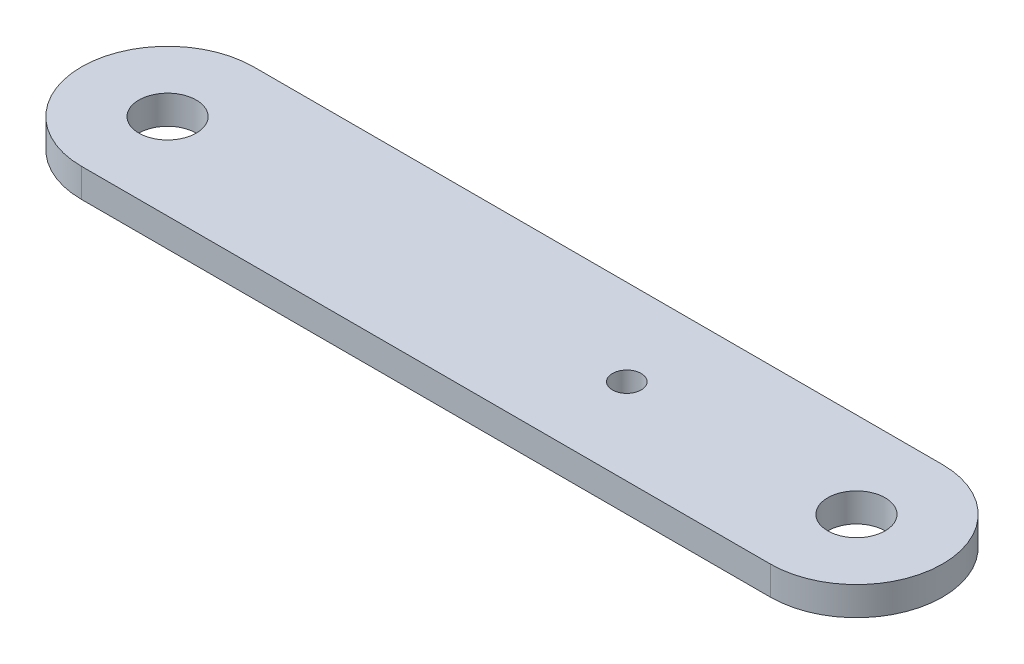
from build123d import *

# Parameters (mm, degrees)
BOSS_EXTRUDE1_DEPTH = 3.175
SKETCH2_R           = 6.35
SKETCH2_R_2         = 3.175
CUT_EXTRUDE1_DEPTH  = 98.343656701


with BuildPart() as part:
    # Sketch1 → Boss-Extrude1 (new, symmetric)
    with BuildSketch(Plane(origin=(0, 0, 0), x_dir=(1, 0, 0), z_dir=(0, 1, 0))):
        with BuildLine():
            Line((-76.2, -19.05), (76.2, -19.05))
            ThreePointArc((76.2, -19.05), (95.25, 0), (76.2, 19.05))
            Line((76.2, 19.05), (-76.2, 19.05))
            ThreePointArc((-76.2, 19.05), (-95.25, 0), (-76.2, -19.05))
        make_face()
    extrude(amount=BOSS_EXTRUDE1_DEPTH, both=True)

    # Sketch2 → Cut-Extrude1 (cut, through all)
    with BuildSketch(Plane(origin=(0, 3.175, 0), x_dir=(1, 0, 0), z_dir=(0, 1, 0))):
        with Locations(Location((-76.2, 0, 0), (0, 0, 270))):
            Circle(SKETCH2_R)
        with Locations(Location((76.2, 0, 0), (0, 0, 270))):
            Circle(SKETCH2_R)
        with Locations(Location((25.4, 0, 0), (0, 0, 270))):
            Circle(SKETCH2_R_2)
    extrude(amount=-CUT_EXTRUDE1_DEPTH, mode=Mode.SUBTRACT)


solid = part.part
